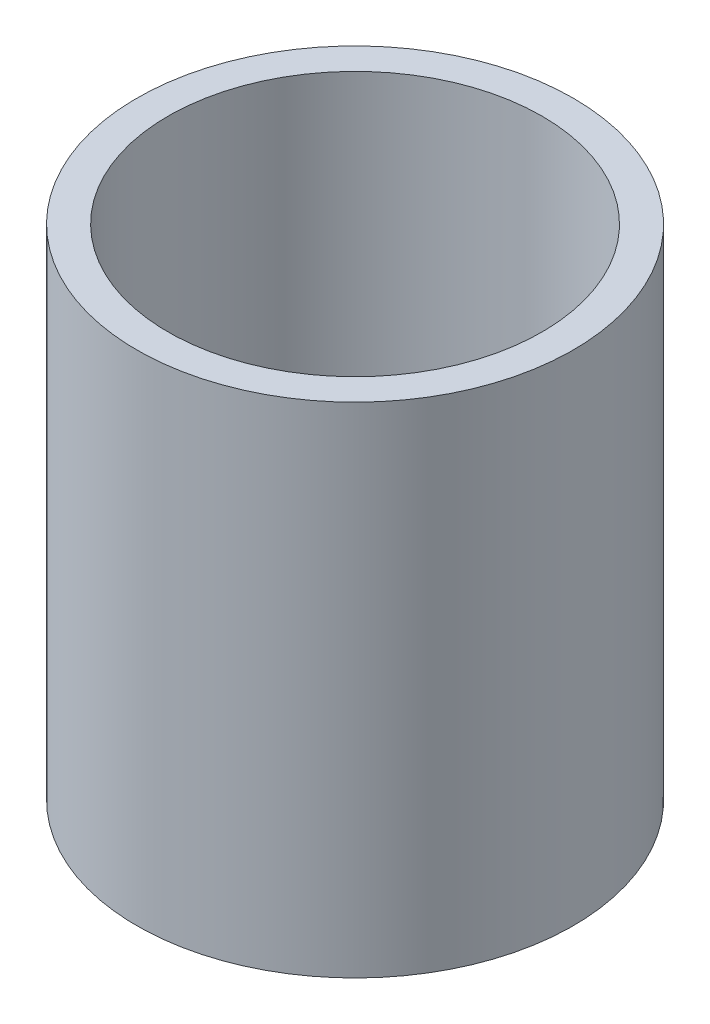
from build123d import *

# Parameters (mm, degrees)
SKETCH1_W = 0.79375
SKETCH1_H = 12.7


with BuildPart() as part:
    # Sketch1 → Revolve1 (revolve)
    with BuildSketch(Plane.XY, mode=Mode.PRIVATE) as revolve1_sk:
        with Locations((-5.159375, 6.35)):
            Rectangle(SKETCH1_W, SKETCH1_H)
    revolve(revolve1_sk.sketch.rotate(Axis((0, 0, 0), (0, 1, 0)), 270), axis=Axis((0, 0, 0), (0, 1, 0)))


solid = part.part
